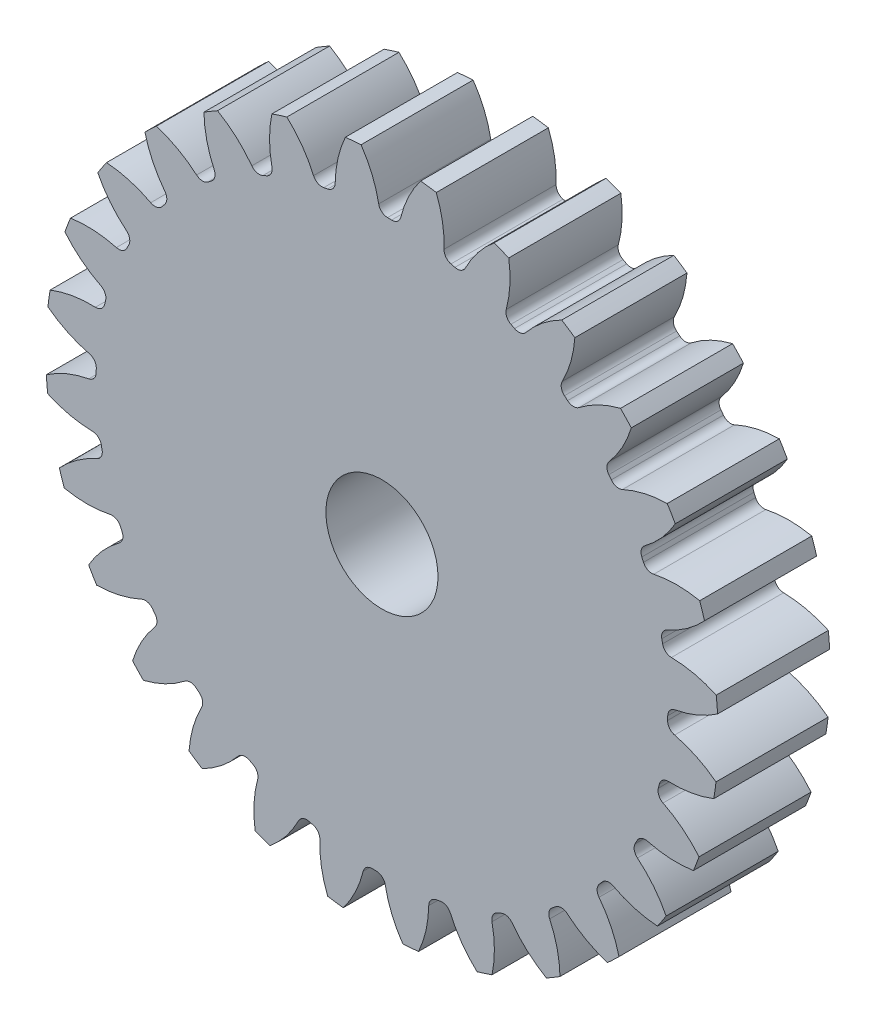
from build123d import *

# Parameters (mm, degrees)
SKETCH3_R         = 304.8
GEARBODY_DEPTH    = 101.6
TOOTHCUT_DEPTH    = 443.864132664
CIRPATTERN1_COUNT = 28
BOREDIA_R         = 50.8
BORE_DEPTH        = 12700


with BuildPart() as part:
    # Sketch3 → gearBody (new body)
    with BuildSketch(Plane.XY):
        Circle(SKETCH3_R)
    extrude(amount=GEARBODY_DEPTH)

    # Sketch2 → toothCut (cut, through all)
    with BuildSketch(Plane.XY):
        with BuildLine():
            ThreePointArc((258.932503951, -8.74098379), (258.988646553, -6.879488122), (259.03140682, -5.017636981))
            ThreePointArc((259.03140682, -5.017636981), (260.983366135, 0.160337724), (265.763351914, 2.948402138))
            ThreePointArc((265.763351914, 2.948402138), (286.150096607, 9.08489175), (304.8, 19.354116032))
            ThreePointArc((304.8, 19.354116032), (305.306162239, -8.10981541), (303.342699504, -35.508146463))
            ThreePointArc((303.342699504, -35.508146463), (285.264271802, -24.263311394), (265.232052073, -17.053177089))
            ThreePointArc((265.232052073, -17.053177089), (260.606820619, -14.015282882), (258.932503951, -8.74098379))
        make_face()
    toothcut = extrude(amount=TOOTHCUT_DEPTH, mode=Mode.SUBTRACT)

    # CirPattern1: toothCut ×28 about axis
    cirpattern1_axis = Axis((0, 0, 0), (0, 0, 1))
    for i in range(1, CIRPATTERN1_COUNT):
        add(toothcut.rotate(cirpattern1_axis, i * 360 / CIRPATTERN1_COUNT), mode=Mode.SUBTRACT)

    # boreDia → bore (cut, symmetric)
    with BuildSketch(Plane.XY):
        Circle(BOREDIA_R)
    extrude(amount=BORE_DEPTH, both=True, mode=Mode.SUBTRACT)


solid = part.part
